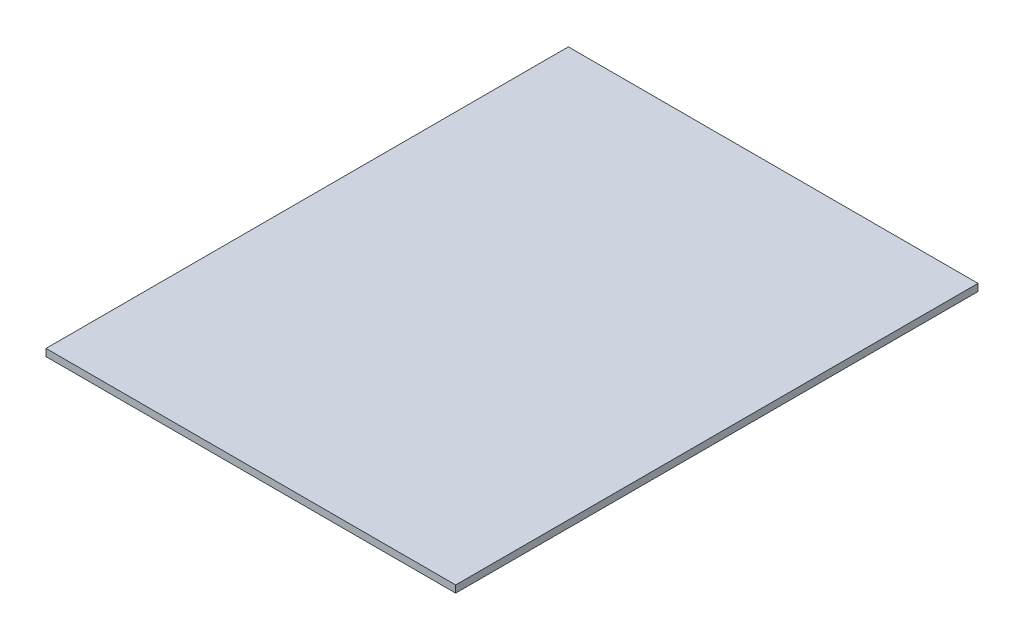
ISO-10303-21;
HEADER;
FILE_DESCRIPTION(('STEP AP214'),'2;1');
FILE_NAME('part.step','',(''),(''),'','','');
FILE_SCHEMA(('AUTOMOTIVE_DESIGN { 1 0 10303 214 1 1 1 1 }'));
ENDSEC;
DATA;
#1=APPLICATION_CONTEXT('core data for automotive mechanical design processes');
#2=APPLICATION_PROTOCOL_DEFINITION('international standard','automotive_design',2000,#1);
#3=PRODUCT_CONTEXT('',#1,'mechanical');
#4=PRODUCT('Part','Part','',(#3));
#5=PRODUCT_RELATED_PRODUCT_CATEGORY('part','',(#4));
#6=PRODUCT_DEFINITION_FORMATION('','',#4);
#7=PRODUCT_DEFINITION_CONTEXT('part definition',#1,'design');
#8=PRODUCT_DEFINITION('design','',#6,#7);
#9=PRODUCT_DEFINITION_SHAPE('','',#8);
#10=(LENGTH_UNIT() NAMED_UNIT(*) SI_UNIT(.MILLI.,.METRE.));
#11=(NAMED_UNIT(*) PLANE_ANGLE_UNIT() SI_UNIT($,.RADIAN.));
#12=(NAMED_UNIT(*) SI_UNIT($,.STERADIAN.) SOLID_ANGLE_UNIT());
#13=UNCERTAINTY_MEASURE_WITH_UNIT(LENGTH_MEASURE(1.E-05),#10,'distance_accuracy_value','');
#14=(GEOMETRIC_REPRESENTATION_CONTEXT(3) GLOBAL_UNCERTAINTY_ASSIGNED_CONTEXT((#13)) GLOBAL_UNIT_ASSIGNED_CONTEXT((#10,
#11,#12)) REPRESENTATION_CONTEXT('',''));
#15=CARTESIAN_POINT('',(0.,0.,0.));
#16=DIRECTION('',(0.,0.,1.));
#17=DIRECTION('',(1.,0.,0.));
#18=AXIS2_PLACEMENT_3D('',#15,#16,#17);
#19=CARTESIAN_POINT('',(0.,2.54,0.));
#20=DIRECTION('',(1.,0.,0.));
#21=DIRECTION('',(0.,0.,-1.));
#22=AXIS2_PLACEMENT_3D('',#19,#20,#21);
#23=PLANE('',#22);
#24=DIRECTION('',(0.,0.,1.));
#25=VECTOR('',#24,1.);
#26=CARTESIAN_POINT('',(0.,0.,0.));
#27=LINE('',#26,#25);
#28=CARTESIAN_POINT('',(0.,0.,-186.172895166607));
#29=VERTEX_POINT('',#28);
#30=CARTESIAN_POINT('',(0.,0.,0.));
#31=VERTEX_POINT('',#30);
#32=EDGE_CURVE('E94',#29,#31,#27,.T.);
#33=ORIENTED_EDGE('',*,*,#32,.T.);
#34=DIRECTION('',(0.,-1.,0.));
#35=VECTOR('',#34,1.);
#36=CARTESIAN_POINT('',(0.,2.54,0.));
#37=LINE('',#36,#35);
#38=CARTESIAN_POINT('',(0.,2.54,0.));
#39=VERTEX_POINT('',#38);
#40=EDGE_CURVE('E11',#39,#31,#37,.T.);
#41=ORIENTED_EDGE('',*,*,#40,.F.);
#42=DIRECTION('',(0.,0.,1.));
#43=VECTOR('',#42,1.);
#44=CARTESIAN_POINT('',(0.,2.54,0.));
#45=LINE('',#44,#43);
#46=CARTESIAN_POINT('',(0.,2.54,-186.172895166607));
#47=VERTEX_POINT('',#46);
#48=EDGE_CURVE('E82',#47,#39,#45,.T.);
#49=ORIENTED_EDGE('',*,*,#48,.F.);
#50=DIRECTION('',(0.,-1.,0.));
#51=VECTOR('',#50,1.);
#52=CARTESIAN_POINT('',(0.,2.54,-186.172895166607));
#53=LINE('',#52,#51);
#54=EDGE_CURVE('E90',#47,#29,#53,.T.);
#55=ORIENTED_EDGE('',*,*,#54,.T.);
#56=EDGE_LOOP('',(#33,#41,#49,#55));
#57=FACE_BOUND('',#56,.T.);
#58=ADVANCED_FACE('F31',(#57),#23,.F.);
#59=CARTESIAN_POINT('',(0.,2.54,0.));
#60=DIRECTION('',(0.,0.,-1.));
#61=DIRECTION('',(-1.,0.,0.));
#62=AXIS2_PLACEMENT_3D('',#59,#60,#61);
#63=PLANE('',#62);
#64=DIRECTION('',(1.,0.,0.));
#65=VECTOR('',#64,1.);
#66=CARTESIAN_POINT('',(0.,0.,0.));
#67=LINE('',#66,#65);
#68=CARTESIAN_POINT('',(146.018315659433,0.,0.));
#69=VERTEX_POINT('',#68);
#70=EDGE_CURVE('E86',#31,#69,#67,.T.);
#71=ORIENTED_EDGE('',*,*,#70,.T.);
#72=DIRECTION('',(0.,-1.,0.));
#73=VECTOR('',#72,1.);
#74=CARTESIAN_POINT('',(146.018315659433,2.54,0.));
#75=LINE('',#74,#73);
#76=CARTESIAN_POINT('',(146.018315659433,2.54,0.));
#77=VERTEX_POINT('',#76);
#78=EDGE_CURVE('E39',#77,#69,#75,.T.);
#79=ORIENTED_EDGE('',*,*,#78,.F.);
#80=DIRECTION('',(1.,0.,0.));
#81=VECTOR('',#80,1.);
#82=CARTESIAN_POINT('',(0.,2.54,0.));
#83=LINE('',#82,#81);
#84=EDGE_CURVE('E77',#39,#77,#83,.T.);
#85=ORIENTED_EDGE('',*,*,#84,.F.);
#86=ORIENTED_EDGE('',*,*,#40,.T.);
#87=EDGE_LOOP('',(#71,#79,#85,#86));
#88=FACE_BOUND('',#87,.T.);
#89=ADVANCED_FACE('F85',(#88),#63,.F.);
#90=CARTESIAN_POINT('',(146.018315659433,2.54,0.));
#91=DIRECTION('',(-1.,0.,0.));
#92=DIRECTION('',(0.,0.,1.));
#93=AXIS2_PLACEMENT_3D('',#90,#91,#92);
#94=PLANE('',#93);
#95=DIRECTION('',(0.,0.,-1.));
#96=VECTOR('',#95,1.);
#97=CARTESIAN_POINT('',(146.018315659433,0.,0.));
#98=LINE('',#97,#96);
#99=CARTESIAN_POINT('',(146.018315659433,0.,-186.172895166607));
#100=VERTEX_POINT('',#99);
#101=EDGE_CURVE('E64',#69,#100,#98,.T.);
#102=ORIENTED_EDGE('',*,*,#101,.T.);
#103=DIRECTION('',(0.,-1.,0.));
#104=VECTOR('',#103,1.);
#105=CARTESIAN_POINT('',(146.018315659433,2.54,-186.172895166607));
#106=LINE('',#105,#104);
#107=CARTESIAN_POINT('',(146.018315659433,2.54,-186.172895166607));
#108=VERTEX_POINT('',#107);
#109=EDGE_CURVE('E87',#108,#100,#106,.T.);
#110=ORIENTED_EDGE('',*,*,#109,.F.);
#111=DIRECTION('',(0.,0.,-1.));
#112=VECTOR('',#111,1.);
#113=CARTESIAN_POINT('',(146.018315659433,2.54,0.));
#114=LINE('',#113,#112);
#115=EDGE_CURVE('E80',#77,#108,#114,.T.);
#116=ORIENTED_EDGE('',*,*,#115,.F.);
#117=ORIENTED_EDGE('',*,*,#78,.T.);
#118=EDGE_LOOP('',(#102,#110,#116,#117));
#119=FACE_BOUND('',#118,.T.);
#120=ADVANCED_FACE('F88',(#119),#94,.F.);
#121=CARTESIAN_POINT('',(0.,2.54,-186.172895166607));
#122=DIRECTION('',(0.,0.,1.));
#123=DIRECTION('',(1.,0.,0.));
#124=AXIS2_PLACEMENT_3D('',#121,#122,#123);
#125=PLANE('',#124);
#126=DIRECTION('',(-1.,0.,0.));
#127=VECTOR('',#126,1.);
#128=CARTESIAN_POINT('',(0.,0.,-186.172895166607));
#129=LINE('',#128,#127);
#130=EDGE_CURVE('E70',#100,#29,#129,.T.);
#131=ORIENTED_EDGE('',*,*,#130,.T.);
#132=ORIENTED_EDGE('',*,*,#54,.F.);
#133=DIRECTION('',(-1.,0.,0.));
#134=VECTOR('',#133,1.);
#135=CARTESIAN_POINT('',(0.,2.54,-186.172895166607));
#136=LINE('',#135,#134);
#137=EDGE_CURVE('E47',#108,#47,#136,.T.);
#138=ORIENTED_EDGE('',*,*,#137,.F.);
#139=ORIENTED_EDGE('',*,*,#109,.T.);
#140=EDGE_LOOP('',(#131,#132,#138,#139));
#141=FACE_BOUND('',#140,.T.);
#142=ADVANCED_FACE('F101',(#141),#125,.F.);
#143=CARTESIAN_POINT('',(0.,2.54,-186.172895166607));
#144=DIRECTION('',(0.,-1.,0.));
#145=DIRECTION('',(0.,0.,-1.));
#146=AXIS2_PLACEMENT_3D('',#143,#144,#145);
#147=PLANE('',#146);
#148=ORIENTED_EDGE('',*,*,#48,.T.);
#149=ORIENTED_EDGE('',*,*,#84,.T.);
#150=ORIENTED_EDGE('',*,*,#115,.T.);
#151=ORIENTED_EDGE('',*,*,#137,.T.);
#152=EDGE_LOOP('',(#148,#149,#150,#151));
#153=FACE_BOUND('',#152,.T.);
#154=ADVANCED_FACE('F78',(#153),#147,.F.);
#155=CARTESIAN_POINT('',(0.,0.,-186.172895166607));
#156=DIRECTION('',(0.,-1.,0.));
#157=DIRECTION('',(0.,0.,-1.));
#158=AXIS2_PLACEMENT_3D('',#155,#156,#157);
#159=PLANE('',#158);
#160=ORIENTED_EDGE('',*,*,#32,.F.);
#161=ORIENTED_EDGE('',*,*,#130,.F.);
#162=ORIENTED_EDGE('',*,*,#101,.F.);
#163=ORIENTED_EDGE('',*,*,#70,.F.);
#164=EDGE_LOOP('',(#160,#161,#162,#163));
#165=FACE_BOUND('',#164,.T.);
#166=ADVANCED_FACE('F104',(#165),#159,.T.);
#167=CLOSED_SHELL('',(#58,#89,#120,#142,#154,#166));
#168=MANIFOLD_SOLID_BREP('B2',#167);
#169=ADVANCED_BREP_SHAPE_REPRESENTATION('',(#18,#168),#14);
#170=SHAPE_DEFINITION_REPRESENTATION(#9,#169);
ENDSEC;
END-ISO-10303-21;
